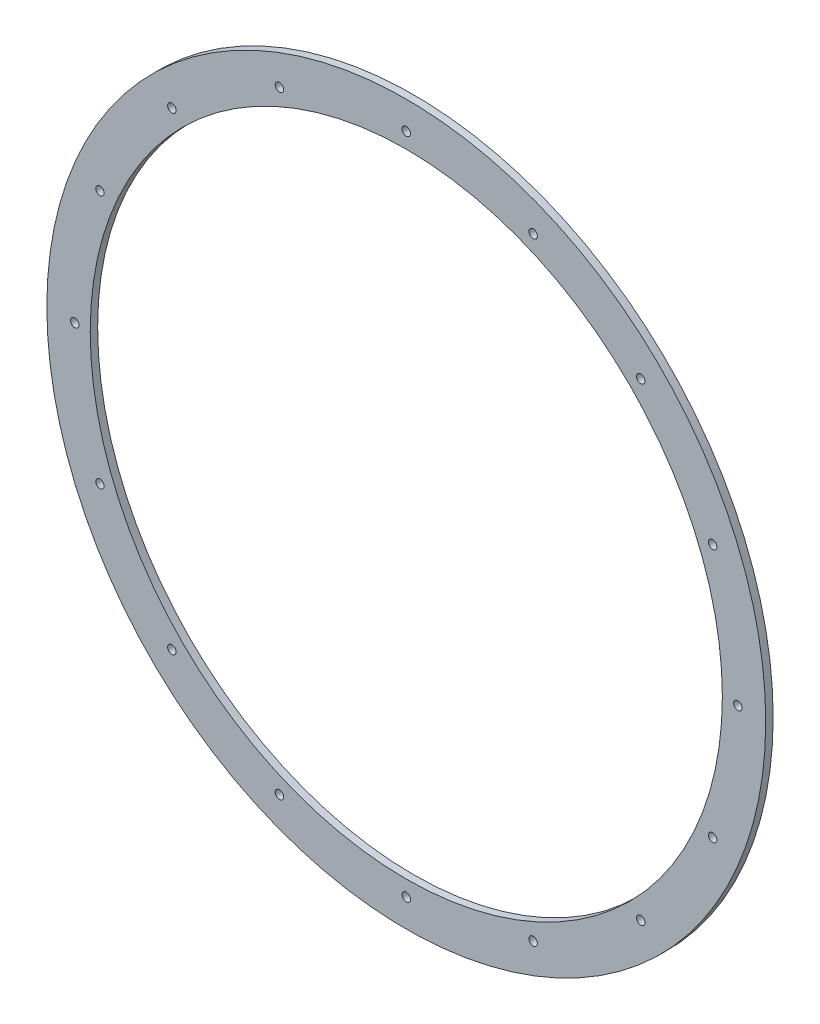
from build123d import *

# Parameters (mm, degrees)
SKETCH_1_R               = 290
SKETCH_1_R_2             = 255
EXTRUDE_1_DEPTH          = 3
HOLE_WIZARD_M8_1_D       = 6.8
PATTERN_CIRCULAR_1_COUNT = 16


with BuildPart() as part:
    # Sketch 1 → Extrude 1 (new, symmetric)
    with BuildSketch(Plane.XY):
        Circle(SKETCH_1_R)
        Circle(SKETCH_1_R_2, mode=Mode.SUBTRACT)
    extrude(amount=EXTRUDE_1_DEPTH, both=True)

    # Hole Wizard M8 _1 (through all)
    with Locations(Plane(origin=(0, 0, -3), x_dir=(-1, 0, 0), z_dir=(0, 0, -1))):
        with Locations((0, 267.5)):
            hole_wizard_m8_1 = Hole(HOLE_WIZARD_M8_1_D / 2)

    # Pattern Circular 1: Hole Wizard M8 _1 ×16 about axis
    pattern_circular_1_axis = Axis((0, 0, 0), (0, 0, 1))
    for i in range(1, PATTERN_CIRCULAR_1_COUNT):
        add(hole_wizard_m8_1.rotate(pattern_circular_1_axis, i * 360 / PATTERN_CIRCULAR_1_COUNT), mode=Mode.SUBTRACT)


solid = part.part
